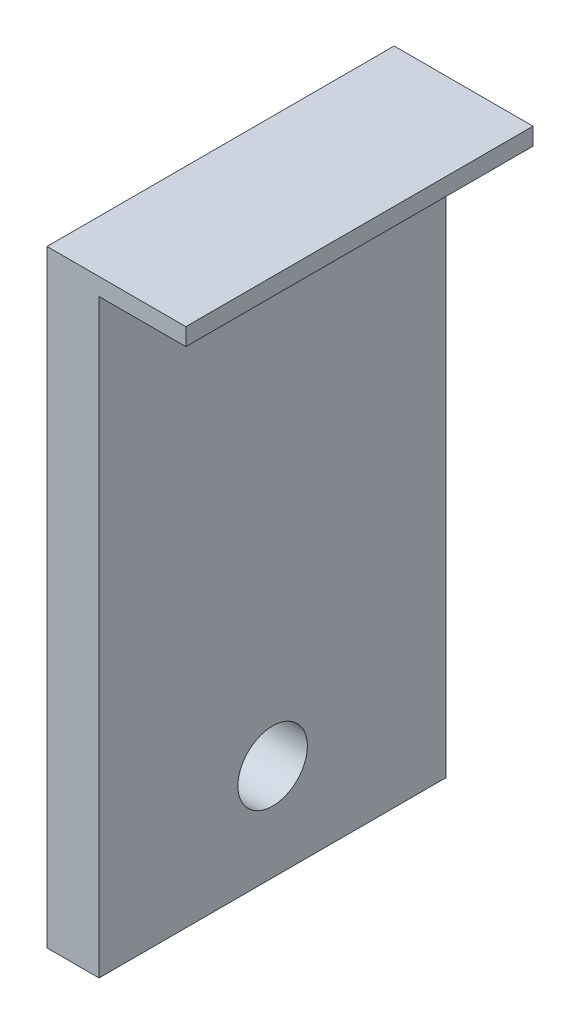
from build123d import *

# Parameters (mm, degrees)
SKETCH1_W           = 3
SKETCH1_H           = 20
BOSS_EXTRUDE1_DEPTH = 35
SKETCH2_W           = 20
SKETCH2_H           = 1
BOSS_EXTRUDE2_DEPTH = 5
SKETCH3_R           = 2
CUT_EXTRUDE1_DEPTH  = 5


with BuildPart() as part:
    # Sketch1 → Boss-Extrude1 (new body)
    with BuildSketch(Plane(origin=(0, 0, 0), x_dir=(1, 0, 0), z_dir=(0, 1, 0))):
        with Locations((1.5, 10)):
            Rectangle(SKETCH1_W, SKETCH1_H)
    extrude(amount=BOSS_EXTRUDE1_DEPTH)

    # Sketch2 → Boss-Extrude2 (add)
    with BuildSketch(Plane(origin=(3, 0, 0), x_dir=(0, 0, -1), z_dir=(1, 0, 0))):
        with Locations((10, 34.5)):
            Rectangle(SKETCH2_W, SKETCH2_H)
    extrude(amount=BOSS_EXTRUDE2_DEPTH)

    # Sketch3 → Cut-Extrude1 (cut)
    with BuildSketch(Plane.ZY):
        with Locations((-10, 5.579853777)):
            Circle(SKETCH3_R)
    extrude(amount=-CUT_EXTRUDE1_DEPTH, mode=Mode.SUBTRACT)


solid = part.part
